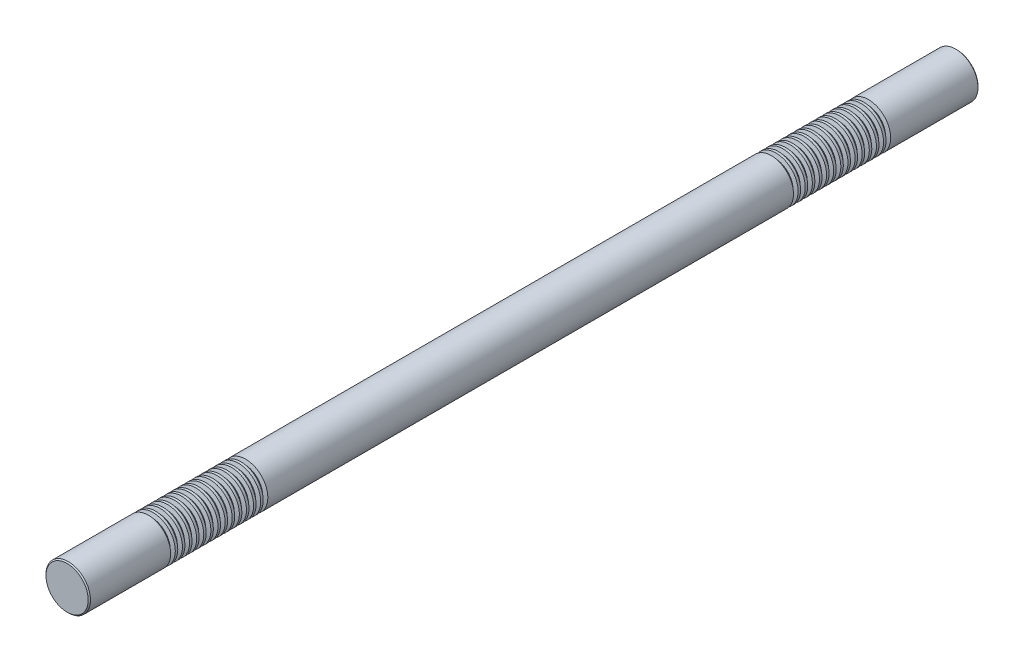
from build123d import *

# Parameters (mm, degrees)
SKETCH1_R           = 25
BOSS_EXTRUDE1_DEPTH = 500
CHAMFER1_SIZE       = 1.25
LPATTERN1_COUNT     = 14
LPATTERN1_PITCH     = 8
LPATTERN2_COUNT     = 2
LPATTERN2_PITCH     = 700


with BuildPart() as part:
    # Sketch1 → Boss-Extrude1 (new, symmetric)
    with BuildSketch(Plane.XY):
        Circle(SKETCH1_R)
    extrude(amount=BOSS_EXTRUDE1_DEPTH, both=True)

    # Chamfer1
    chamfer1_edges = [part.edges().sort_by_distance(p)[0] for p in [
        (-25, 0, -500),
        (-25, 0, 500),
    ]]
    chamfer(chamfer1_edges, length=CHAMFER1_SIZE)

    # Sketch2 → Cut-Revolve1 (revolve, cut)
    with BuildSketch(Plane(origin=(0, 0, 0), x_dir=(0, 0, -1), z_dir=(1, 0, 0)), mode=Mode.PRIVATE) as cut_revolve1_sk:
        Polygon((400.602885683, 25), (395.397114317, 25), (396.602885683, 20.5), (399.397114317, 20.5), align=None)
    cut_revolve1 = revolve(cut_revolve1_sk.sketch.rotate(Axis((0, 0, 500), (0, 0, -1)), 90), axis=Axis((0, 0, 500), (0, 0, -1)), mode=Mode.SUBTRACT)

    # LPattern1: Cut-Revolve1 ×14
    with Locations(*[(0, 0, i * LPATTERN1_PITCH) for i in range(1, LPATTERN1_COUNT)]):
        add(cut_revolve1, mode=Mode.SUBTRACT)

    # LPattern2: Cut-Revolve1 ×2
    with Locations(*[(0, 0, i * LPATTERN2_PITCH) for i in range(1, LPATTERN2_COUNT)]):
        add(cut_revolve1, mode=Mode.SUBTRACT)

    # LPattern2 copy 1 sketch → LPattern2 copy 1 (revolve, cut)
    with BuildSketch(Plane(origin=(0, 0, 708), x_dir=(0, 0, -1), z_dir=(1, 0, 0))):
        Polygon((400.602885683, 25), (395.397114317, 25), (396.602885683, 20.5), (399.397114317, 20.5), align=None)
    revolve(axis=Axis((0, 0, 1208), (0, 0, -1)), mode=Mode.SUBTRACT)

    # LPattern2 copy 2 sketch → LPattern2 copy 2 (revolve, cut)
    with BuildSketch(Plane(origin=(0, 0, 716), x_dir=(0, 0, -1), z_dir=(1, 0, 0))):
        Polygon((400.602885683, 25), (395.397114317, 25), (396.602885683, 20.5), (399.397114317, 20.5), align=None)
    revolve(axis=Axis((0, 0, 1216), (0, 0, -1)), mode=Mode.SUBTRACT)

    # LPattern2 copy 3 sketch → LPattern2 copy 3 (revolve, cut)
    with BuildSketch(Plane(origin=(0, 0, 724), x_dir=(0, 0, -1), z_dir=(1, 0, 0))):
        Polygon((400.602885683, 25), (395.397114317, 25), (396.602885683, 20.5), (399.397114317, 20.5), align=None)
    revolve(axis=Axis((0, 0, 1224), (0, 0, -1)), mode=Mode.SUBTRACT)

    # LPattern2 copy 4 sketch → LPattern2 copy 4 (revolve, cut)
    with BuildSketch(Plane(origin=(0, 0, 732), x_dir=(0, 0, -1), z_dir=(1, 0, 0))):
        Polygon((400.602885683, 25), (395.397114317, 25), (396.602885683, 20.5), (399.397114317, 20.5), align=None)
    revolve(axis=Axis((0, 0, 1232), (0, 0, -1)), mode=Mode.SUBTRACT)

    # LPattern2 copy 5 sketch → LPattern2 copy 5 (revolve, cut)
    with BuildSketch(Plane(origin=(0, 0, 740), x_dir=(0, 0, -1), z_dir=(1, 0, 0))):
        Polygon((400.602885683, 25), (395.397114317, 25), (396.602885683, 20.5), (399.397114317, 20.5), align=None)
    revolve(axis=Axis((0, 0, 1240), (0, 0, -1)), mode=Mode.SUBTRACT)

    # LPattern2 copy 6 sketch → LPattern2 copy 6 (revolve, cut)
    with BuildSketch(Plane(origin=(0, 0, 748), x_dir=(0, 0, -1), z_dir=(1, 0, 0))):
        Polygon((400.602885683, 25), (395.397114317, 25), (396.602885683, 20.5), (399.397114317, 20.5), align=None)
    revolve(axis=Axis((0, 0, 1248), (0, 0, -1)), mode=Mode.SUBTRACT)

    # LPattern2 copy 7 sketch → LPattern2 copy 7 (revolve, cut)
    with BuildSketch(Plane(origin=(0, 0, 756), x_dir=(0, 0, -1), z_dir=(1, 0, 0))):
        Polygon((400.602885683, 25), (395.397114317, 25), (396.602885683, 20.5), (399.397114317, 20.5), align=None)
    revolve(axis=Axis((0, 0, 1256), (0, 0, -1)), mode=Mode.SUBTRACT)

    # LPattern2 copy 8 sketch → LPattern2 copy 8 (revolve, cut)
    with BuildSketch(Plane(origin=(0, 0, 764), x_dir=(0, 0, -1), z_dir=(1, 0, 0))):
        Polygon((400.602885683, 25), (395.397114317, 25), (396.602885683, 20.5), (399.397114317, 20.5), align=None)
    revolve(axis=Axis((0, 0, 1264), (0, 0, -1)), mode=Mode.SUBTRACT)

    # LPattern2 copy 9 sketch → LPattern2 copy 9 (revolve, cut)
    with BuildSketch(Plane(origin=(0, 0, 772), x_dir=(0, 0, -1), z_dir=(1, 0, 0))):
        Polygon((400.602885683, 25), (395.397114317, 25), (396.602885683, 20.5), (399.397114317, 20.5), align=None)
    revolve(axis=Axis((0, 0, 1272), (0, 0, -1)), mode=Mode.SUBTRACT)

    # LPattern2 copy 10 sketch → LPattern2 copy 10 (revolve, cut)
    with BuildSketch(Plane(origin=(0, 0, 780), x_dir=(0, 0, -1), z_dir=(1, 0, 0))):
        Polygon((400.602885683, 25), (395.397114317, 25), (396.602885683, 20.5), (399.397114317, 20.5), align=None)
    revolve(axis=Axis((0, 0, 1280), (0, 0, -1)), mode=Mode.SUBTRACT)

    # LPattern2 copy 11 sketch → LPattern2 copy 11 (revolve, cut)
    with BuildSketch(Plane(origin=(0, 0, 788), x_dir=(0, 0, -1), z_dir=(1, 0, 0))):
        Polygon((400.602885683, 25), (395.397114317, 25), (396.602885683, 20.5), (399.397114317, 20.5), align=None)
    revolve(axis=Axis((0, 0, 1288), (0, 0, -1)), mode=Mode.SUBTRACT)

    # LPattern2 copy 12 sketch → LPattern2 copy 12 (revolve, cut)
    with BuildSketch(Plane(origin=(0, 0, 796), x_dir=(0, 0, -1), z_dir=(1, 0, 0))):
        Polygon((400.602885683, 25), (395.397114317, 25), (396.602885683, 20.5), (399.397114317, 20.5), align=None)
    revolve(axis=Axis((0, 0, 1296), (0, 0, -1)), mode=Mode.SUBTRACT)

    # LPattern2 copy 13 sketch → LPattern2 copy 13 (revolve, cut)
    with BuildSketch(Plane(origin=(0, 0, 804), x_dir=(0, 0, -1), z_dir=(1, 0, 0))):
        Polygon((400.602885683, 25), (395.397114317, 25), (396.602885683, 20.5), (399.397114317, 20.5), align=None)
    revolve(axis=Axis((0, 0, 1304), (0, 0, -1)), mode=Mode.SUBTRACT)


solid = part.part
